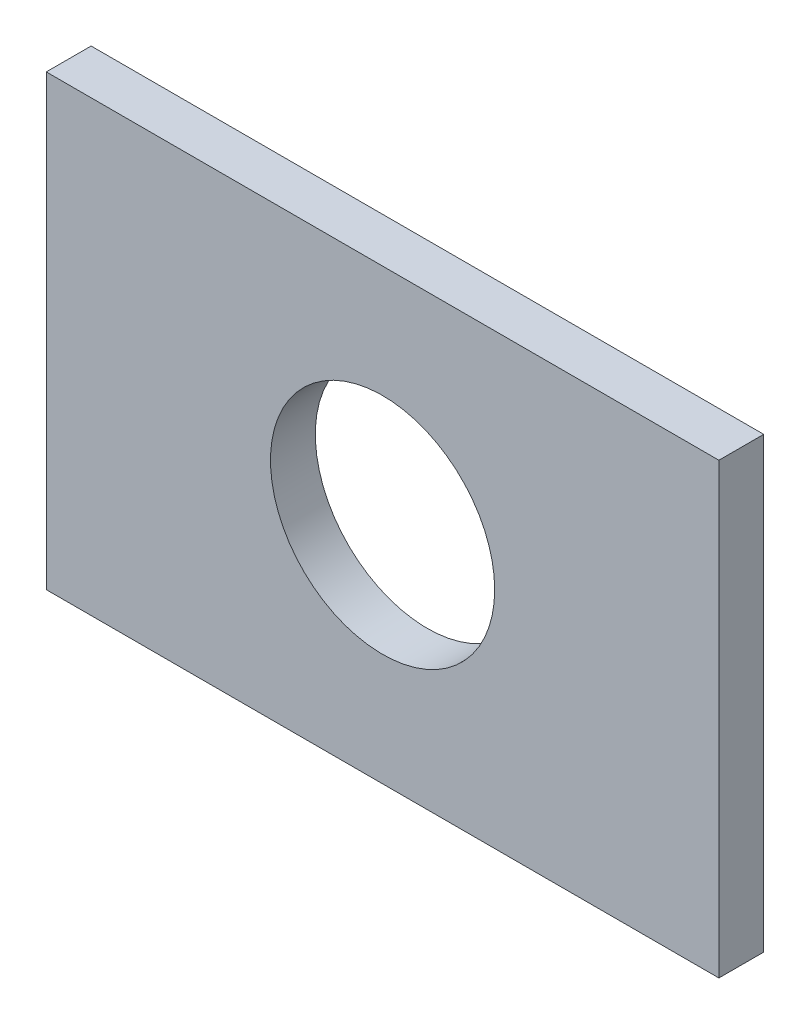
ISO-10303-21;
HEADER;
FILE_DESCRIPTION(('STEP AP214'),'2;1');
FILE_NAME('part.step','',(''),(''),'','','');
FILE_SCHEMA(('AUTOMOTIVE_DESIGN { 1 0 10303 214 1 1 1 1 }'));
ENDSEC;
DATA;
#1=APPLICATION_CONTEXT('core data for automotive mechanical design processes');
#2=APPLICATION_PROTOCOL_DEFINITION('international standard','automotive_design',2000,#1);
#3=PRODUCT_CONTEXT('',#1,'mechanical');
#4=PRODUCT('Part','Part','',(#3));
#5=PRODUCT_RELATED_PRODUCT_CATEGORY('part','',(#4));
#6=PRODUCT_DEFINITION_FORMATION('','',#4);
#7=PRODUCT_DEFINITION_CONTEXT('part definition',#1,'design');
#8=PRODUCT_DEFINITION('design','',#6,#7);
#9=PRODUCT_DEFINITION_SHAPE('','',#8);
#10=(LENGTH_UNIT() NAMED_UNIT(*) SI_UNIT(.MILLI.,.METRE.));
#11=(NAMED_UNIT(*) PLANE_ANGLE_UNIT() SI_UNIT($,.RADIAN.));
#12=(NAMED_UNIT(*) SI_UNIT($,.STERADIAN.) SOLID_ANGLE_UNIT());
#13=UNCERTAINTY_MEASURE_WITH_UNIT(LENGTH_MEASURE(1.E-05),#10,'distance_accuracy_value','');
#14=(GEOMETRIC_REPRESENTATION_CONTEXT(3) GLOBAL_UNCERTAINTY_ASSIGNED_CONTEXT((#13)) GLOBAL_UNIT_ASSIGNED_CONTEXT((#10,
#11,#12)) REPRESENTATION_CONTEXT('',''));
#15=CARTESIAN_POINT('',(0.,0.,0.));
#16=DIRECTION('',(0.,0.,1.));
#17=DIRECTION('',(1.,0.,0.));
#18=AXIS2_PLACEMENT_3D('',#15,#16,#17);
#19=CARTESIAN_POINT('',(75.0000000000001,50.,10.));
#20=DIRECTION('',(-1.,0.,0.));
#21=DIRECTION('',(0.,0.,1.));
#22=AXIS2_PLACEMENT_3D('',#19,#20,#21);
#23=PLANE('',#22);
#24=DIRECTION('',(0.,1.,0.));
#25=VECTOR('',#24,1.);
#26=CARTESIAN_POINT('',(75.0000000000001,50.,0.));
#27=LINE('',#26,#25);
#28=CARTESIAN_POINT('',(75.0000000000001,-50.,0.));
#29=VERTEX_POINT('',#28);
#30=CARTESIAN_POINT('',(75.0000000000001,50.,0.));
#31=VERTEX_POINT('',#30);
#32=EDGE_CURVE('E104',#29,#31,#27,.T.);
#33=ORIENTED_EDGE('',*,*,#32,.T.);
#34=DIRECTION('',(0.,0.,-1.));
#35=VECTOR('',#34,1.);
#36=CARTESIAN_POINT('',(75.0000000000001,50.,10.));
#37=LINE('',#36,#35);
#38=CARTESIAN_POINT('',(75.0000000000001,50.,10.));
#39=VERTEX_POINT('',#38);
#40=EDGE_CURVE('E12',#39,#31,#37,.T.);
#41=ORIENTED_EDGE('',*,*,#40,.F.);
#42=DIRECTION('',(0.,1.,0.));
#43=VECTOR('',#42,1.);
#44=CARTESIAN_POINT('',(75.0000000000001,50.,10.));
#45=LINE('',#44,#43);
#46=CARTESIAN_POINT('',(75.0000000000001,-50.,10.));
#47=VERTEX_POINT('',#46);
#48=EDGE_CURVE('E93',#47,#39,#45,.T.);
#49=ORIENTED_EDGE('',*,*,#48,.F.);
#50=DIRECTION('',(0.,0.,-1.));
#51=VECTOR('',#50,1.);
#52=CARTESIAN_POINT('',(75.0000000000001,-50.,10.));
#53=LINE('',#52,#51);
#54=EDGE_CURVE('E101',#47,#29,#53,.T.);
#55=ORIENTED_EDGE('',*,*,#54,.T.);
#56=EDGE_LOOP('',(#33,#41,#49,#55));
#57=FACE_BOUND('',#56,.T.);
#58=ADVANCED_FACE('F42',(#57),#23,.F.);
#59=CARTESIAN_POINT('',(-74.9999999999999,50.,10.));
#60=DIRECTION('',(0.,-1.,0.));
#61=DIRECTION('',(0.,0.,-1.));
#62=AXIS2_PLACEMENT_3D('',#59,#60,#61);
#63=PLANE('',#62);
#64=DIRECTION('',(-1.,0.,0.));
#65=VECTOR('',#64,1.);
#66=CARTESIAN_POINT('',(-74.9999999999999,50.,0.));
#67=LINE('',#66,#65);
#68=CARTESIAN_POINT('',(-74.9999999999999,50.,0.));
#69=VERTEX_POINT('',#68);
#70=EDGE_CURVE('E97',#31,#69,#67,.T.);
#71=ORIENTED_EDGE('',*,*,#70,.T.);
#72=DIRECTION('',(0.,0.,-1.));
#73=VECTOR('',#72,1.);
#74=CARTESIAN_POINT('',(-74.9999999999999,50.,10.));
#75=LINE('',#74,#73);
#76=CARTESIAN_POINT('',(-74.9999999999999,50.,10.));
#77=VERTEX_POINT('',#76);
#78=EDGE_CURVE('E50',#77,#69,#75,.T.);
#79=ORIENTED_EDGE('',*,*,#78,.F.);
#80=DIRECTION('',(-1.,0.,0.));
#81=VECTOR('',#80,1.);
#82=CARTESIAN_POINT('',(-74.9999999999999,50.,10.));
#83=LINE('',#82,#81);
#84=EDGE_CURVE('E88',#39,#77,#83,.T.);
#85=ORIENTED_EDGE('',*,*,#84,.F.);
#86=ORIENTED_EDGE('',*,*,#40,.T.);
#87=EDGE_LOOP('',(#71,#79,#85,#86));
#88=FACE_BOUND('',#87,.T.);
#89=ADVANCED_FACE('F96',(#88),#63,.F.);
#90=CARTESIAN_POINT('',(-74.9999999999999,50.,10.));
#91=DIRECTION('',(1.,0.,0.));
#92=DIRECTION('',(0.,0.,-1.));
#93=AXIS2_PLACEMENT_3D('',#90,#91,#92);
#94=PLANE('',#93);
#95=DIRECTION('',(0.,-1.,0.));
#96=VECTOR('',#95,1.);
#97=CARTESIAN_POINT('',(-74.9999999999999,50.,0.));
#98=LINE('',#97,#96);
#99=CARTESIAN_POINT('',(-74.9999999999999,-50.,0.));
#100=VERTEX_POINT('',#99);
#101=EDGE_CURVE('E75',#69,#100,#98,.T.);
#102=ORIENTED_EDGE('',*,*,#101,.T.);
#103=DIRECTION('',(0.,0.,-1.));
#104=VECTOR('',#103,1.);
#105=CARTESIAN_POINT('',(-74.9999999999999,-50.,10.));
#106=LINE('',#105,#104);
#107=CARTESIAN_POINT('',(-74.9999999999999,-50.,10.));
#108=VERTEX_POINT('',#107);
#109=EDGE_CURVE('E98',#108,#100,#106,.T.);
#110=ORIENTED_EDGE('',*,*,#109,.F.);
#111=DIRECTION('',(0.,-1.,0.));
#112=VECTOR('',#111,1.);
#113=CARTESIAN_POINT('',(-74.9999999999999,50.,10.));
#114=LINE('',#113,#112);
#115=EDGE_CURVE('E91',#77,#108,#114,.T.);
#116=ORIENTED_EDGE('',*,*,#115,.F.);
#117=ORIENTED_EDGE('',*,*,#78,.T.);
#118=EDGE_LOOP('',(#102,#110,#116,#117));
#119=FACE_BOUND('',#118,.T.);
#120=ADVANCED_FACE('F99',(#119),#94,.F.);
#121=CARTESIAN_POINT('',(-74.9999999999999,-50.,10.));
#122=DIRECTION('',(0.,1.,0.));
#123=DIRECTION('',(0.,0.,1.));
#124=AXIS2_PLACEMENT_3D('',#121,#122,#123);
#125=PLANE('',#124);
#126=DIRECTION('',(1.,0.,0.));
#127=VECTOR('',#126,1.);
#128=CARTESIAN_POINT('',(-74.9999999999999,-50.,0.));
#129=LINE('',#128,#127);
#130=EDGE_CURVE('E81',#100,#29,#129,.T.);
#131=ORIENTED_EDGE('',*,*,#130,.T.);
#132=ORIENTED_EDGE('',*,*,#54,.F.);
#133=DIRECTION('',(1.,0.,0.));
#134=VECTOR('',#133,1.);
#135=CARTESIAN_POINT('',(-74.9999999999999,-50.,10.));
#136=LINE('',#135,#134);
#137=EDGE_CURVE('E58',#108,#47,#136,.T.);
#138=ORIENTED_EDGE('',*,*,#137,.F.);
#139=ORIENTED_EDGE('',*,*,#109,.T.);
#140=EDGE_LOOP('',(#131,#132,#138,#139));
#141=FACE_BOUND('',#140,.T.);
#142=ADVANCED_FACE('F112',(#141),#125,.F.);
#143=CARTESIAN_POINT('',(0.,0.,10.));
#144=DIRECTION('',(0.,0.,1.));
#145=DIRECTION('',(1.,0.,0.));
#146=AXIS2_PLACEMENT_3D('',#143,#144,#145);
#147=PLANE('',#146);
#148=CARTESIAN_POINT('',(0.,0.,10.));
#149=DIRECTION('',(0.,0.,1.));
#150=DIRECTION('',(1.,0.,0.));
#151=AXIS2_PLACEMENT_3D('',#148,#149,#150);
#152=CIRCLE('',#151,25.);
#153=CARTESIAN_POINT('',(25.,0.,10.));
#154=VERTEX_POINT('',#153);
#155=EDGE_CURVE('E120',#154,#154,#152,.T.);
#156=ORIENTED_EDGE('',*,*,#155,.F.);
#157=EDGE_LOOP('',(#156));
#158=FACE_BOUND('',#157,.T.);
#159=ORIENTED_EDGE('',*,*,#48,.T.);
#160=ORIENTED_EDGE('',*,*,#84,.T.);
#161=ORIENTED_EDGE('',*,*,#115,.T.);
#162=ORIENTED_EDGE('',*,*,#137,.T.);
#163=EDGE_LOOP('',(#159,#160,#161,#162));
#164=FACE_BOUND('',#163,.T.);
#165=ADVANCED_FACE('F89',(#158,#164),#147,.T.);
#166=CARTESIAN_POINT('',(0.,0.,0.));
#167=DIRECTION('',(0.,0.,1.));
#168=DIRECTION('',(1.,0.,0.));
#169=AXIS2_PLACEMENT_3D('',#166,#167,#168);
#170=PLANE('',#169);
#171=CARTESIAN_POINT('',(0.,0.,0.));
#172=DIRECTION('',(0.,0.,1.));
#173=DIRECTION('',(1.,0.,0.));
#174=AXIS2_PLACEMENT_3D('',#171,#172,#173);
#175=CIRCLE('',#174,25.);
#176=CARTESIAN_POINT('',(25.,0.,0.));
#177=VERTEX_POINT('',#176);
#178=EDGE_CURVE('E107',#177,#177,#175,.T.);
#179=ORIENTED_EDGE('',*,*,#178,.T.);
#180=EDGE_LOOP('',(#179));
#181=FACE_BOUND('',#180,.T.);
#182=ORIENTED_EDGE('',*,*,#32,.F.);
#183=ORIENTED_EDGE('',*,*,#130,.F.);
#184=ORIENTED_EDGE('',*,*,#101,.F.);
#185=ORIENTED_EDGE('',*,*,#70,.F.);
#186=EDGE_LOOP('',(#182,#183,#184,#185));
#187=FACE_BOUND('',#186,.T.);
#188=ADVANCED_FACE('F115',(#181,#187),#170,.F.);
#189=CARTESIAN_POINT('',(0.,0.,0.));
#190=DIRECTION('',(0.,0.,1.));
#191=DIRECTION('',(1.,0.,0.));
#192=AXIS2_PLACEMENT_3D('',#189,#190,#191);
#193=CYLINDRICAL_SURFACE('',#192,25.);
#194=ORIENTED_EDGE('',*,*,#178,.F.);
#195=EDGE_LOOP('',(#194));
#196=FACE_BOUND('',#195,.T.);
#197=ORIENTED_EDGE('',*,*,#155,.T.);
#198=EDGE_LOOP('',(#197));
#199=FACE_BOUND('',#198,.T.);
#200=ADVANCED_FACE('F127',(#196,#199),#193,.F.);
#201=CLOSED_SHELL('',(#58,#89,#120,#142,#165,#188,#200));
#202=MANIFOLD_SOLID_BREP('B2',#201);
#203=ADVANCED_BREP_SHAPE_REPRESENTATION('',(#18,#202),#14);
#204=SHAPE_DEFINITION_REPRESENTATION(#9,#203);
ENDSEC;
END-ISO-10303-21;
